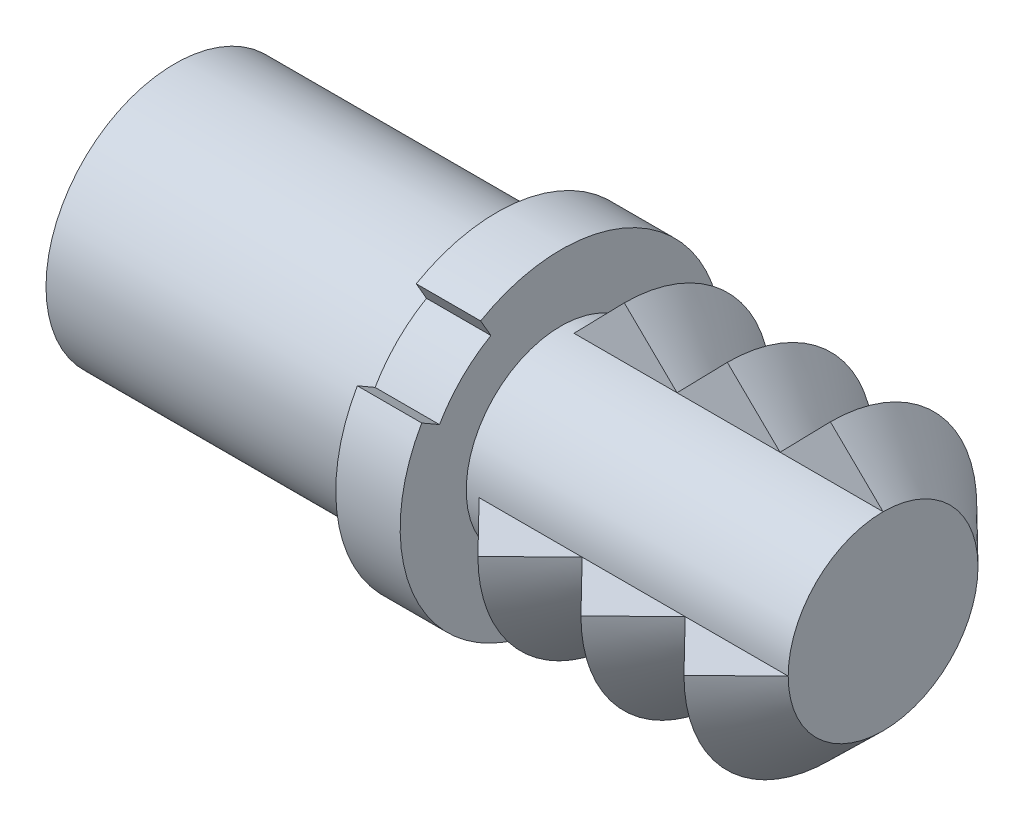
ISO-10303-21;
HEADER;
FILE_DESCRIPTION(('STEP AP214'),'2;1');
FILE_NAME('part.step','',(''),(''),'','','');
FILE_SCHEMA(('AUTOMOTIVE_DESIGN { 1 0 10303 214 1 1 1 1 }'));
ENDSEC;
DATA;
#1=APPLICATION_CONTEXT('core data for automotive mechanical design processes');
#2=APPLICATION_PROTOCOL_DEFINITION('international standard','automotive_design',2000,#1);
#3=PRODUCT_CONTEXT('',#1,'mechanical');
#4=PRODUCT('Part','Part','',(#3));
#5=PRODUCT_RELATED_PRODUCT_CATEGORY('part','',(#4));
#6=PRODUCT_DEFINITION_FORMATION('','',#4);
#7=PRODUCT_DEFINITION_CONTEXT('part definition',#1,'design');
#8=PRODUCT_DEFINITION('design','',#6,#7);
#9=PRODUCT_DEFINITION_SHAPE('','',#8);
#10=(LENGTH_UNIT() NAMED_UNIT(*) SI_UNIT(.MILLI.,.METRE.));
#11=(NAMED_UNIT(*) PLANE_ANGLE_UNIT() SI_UNIT($,.RADIAN.));
#12=(NAMED_UNIT(*) SI_UNIT($,.STERADIAN.) SOLID_ANGLE_UNIT());
#13=UNCERTAINTY_MEASURE_WITH_UNIT(LENGTH_MEASURE(1.E-05),#10,'distance_accuracy_value','');
#14=(GEOMETRIC_REPRESENTATION_CONTEXT(3) GLOBAL_UNCERTAINTY_ASSIGNED_CONTEXT((#13)) GLOBAL_UNIT_ASSIGNED_CONTEXT((#10,
#11,#12)) REPRESENTATION_CONTEXT('',''));
#15=CARTESIAN_POINT('',(0.,0.,0.));
#16=DIRECTION('',(0.,0.,1.));
#17=DIRECTION('',(1.,0.,0.));
#18=AXIS2_PLACEMENT_3D('',#15,#16,#17);
#19=CARTESIAN_POINT('',(18.8096962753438,-7.3213113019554,0.));
#20=DIRECTION('',(-1.,0.,0.));
#21=DIRECTION('',(0.,0.,1.));
#22=AXIS2_PLACEMENT_3D('',#19,#20,#21);
#23=CONICAL_SURFACE('',#22,3.74350399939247,0.773626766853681);
#24=DIRECTION('',(-0.7153812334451,0.,-0.698734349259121));
#25=VECTOR('',#24,1.);
#26=CARTESIAN_POINT('',(22.6423867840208,-7.3213113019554,0.));
#27=LINE('',#26,#25);
#28=CARTESIAN_POINT('',(16.7298617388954,-7.3213113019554,-5.77494089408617));
#29=VERTEX_POINT('',#28);
#30=CARTESIAN_POINT('',(18.8096962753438,-7.3213113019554,-3.74350399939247));
#31=VERTEX_POINT('',#30);
#32=EDGE_CURVE('E220',#29,#31,#27,.F.);
#33=ORIENTED_EDGE('',*,*,#32,.F.);
#34=CARTESIAN_POINT('',(16.7298617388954,-7.3213113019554,0.));
#35=DIRECTION('',(1.,0.,0.));
#36=DIRECTION('',(0.,0.,-1.));
#37=AXIS2_PLACEMENT_3D('',#34,#35,#36);
#38=CIRCLE('',#37,5.77494089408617);
#39=CARTESIAN_POINT('',(16.7298617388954,-1.54637040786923,0.));
#40=VERTEX_POINT('',#39);
#41=EDGE_CURVE('E244',#29,#40,#38,.T.);
#42=ORIENTED_EDGE('',*,*,#41,.T.);
#43=DIRECTION('',(0.7153812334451,-0.698734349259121,0.));
#44=VECTOR('',#43,1.);
#45=CARTESIAN_POINT('',(22.6423867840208,-7.3213113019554,0.));
#46=LINE('',#45,#44);
#47=CARTESIAN_POINT('',(18.8096962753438,-3.57780730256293,0.));
#48=VERTEX_POINT('',#47);
#49=EDGE_CURVE('E343',#48,#40,#46,.F.);
#50=ORIENTED_EDGE('',*,*,#49,.F.);
#51=CARTESIAN_POINT('',(18.8096962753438,-7.3213113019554,0.));
#52=DIRECTION('',(1.,0.,0.));
#53=DIRECTION('',(0.,0.,-1.));
#54=AXIS2_PLACEMENT_3D('',#51,#52,#53);
#55=CIRCLE('',#54,3.74350399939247);
#56=EDGE_CURVE('E248',#31,#48,#55,.T.);
#57=ORIENTED_EDGE('',*,*,#56,.F.);
#58=EDGE_LOOP('',(#33,#42,#50,#57));
#59=FACE_BOUND('',#58,.T.);
#60=ADVANCED_FACE('F35',(#59),#23,.T.);
#61=CARTESIAN_POINT('',(16.7298617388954,-7.3213113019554,0.));
#62=DIRECTION('',(1.,0.,0.));
#63=DIRECTION('',(0.,0.,-1.));
#64=AXIS2_PLACEMENT_3D('',#61,#62,#63);
#65=CONICAL_SURFACE('',#64,5.77494089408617,0.797169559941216);
#66=DIRECTION('',(-0.69873434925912,0.,0.715381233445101));
#67=VECTOR('',#66,1.);
#68=CARTESIAN_POINT('',(11.0893034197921,-7.3213113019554,0.));
#69=LINE('',#68,#67);
#70=CARTESIAN_POINT('',(14.7456962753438,-7.3213113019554,-3.74350399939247));
#71=VERTEX_POINT('',#70);
#72=EDGE_CURVE('E224',#71,#29,#69,.F.);
#73=ORIENTED_EDGE('',*,*,#72,.F.);
#74=CARTESIAN_POINT('',(14.7456962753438,-7.3213113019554,0.));
#75=DIRECTION('',(1.,0.,0.));
#76=DIRECTION('',(0.,0.,-1.));
#77=AXIS2_PLACEMENT_3D('',#74,#75,#76);
#78=CIRCLE('',#77,3.74350399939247);
#79=CARTESIAN_POINT('',(14.7456962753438,-3.57780730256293,0.));
#80=VERTEX_POINT('',#79);
#81=EDGE_CURVE('E240',#71,#80,#78,.T.);
#82=ORIENTED_EDGE('',*,*,#81,.T.);
#83=DIRECTION('',(0.69873434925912,0.715381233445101,0.));
#84=VECTOR('',#83,1.);
#85=CARTESIAN_POINT('',(11.0893034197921,-7.3213113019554,0.));
#86=LINE('',#85,#84);
#87=EDGE_CURVE('E341',#40,#80,#86,.F.);
#88=ORIENTED_EDGE('',*,*,#87,.F.);
#89=ORIENTED_EDGE('',*,*,#41,.F.);
#90=EDGE_LOOP('',(#73,#82,#88,#89));
#91=FACE_BOUND('',#90,.T.);
#92=ADVANCED_FACE('F276',(#91),#65,.T.);
#93=CARTESIAN_POINT('',(14.7456962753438,-7.3213113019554,0.));
#94=DIRECTION('',(-1.,0.,0.));
#95=DIRECTION('',(0.,0.,1.));
#96=AXIS2_PLACEMENT_3D('',#93,#94,#95);
#97=CONICAL_SURFACE('',#96,3.74350399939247,0.773626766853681);
#98=DIRECTION('',(-0.7153812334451,0.,-0.698734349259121));
#99=VECTOR('',#98,1.);
#100=CARTESIAN_POINT('',(18.5783867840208,-7.3213113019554,0.));
#101=LINE('',#100,#99);
#102=CARTESIAN_POINT('',(12.6658617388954,-7.3213113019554,-5.77494089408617));
#103=VERTEX_POINT('',#102);
#104=EDGE_CURVE('E364',#103,#71,#101,.F.);
#105=ORIENTED_EDGE('',*,*,#104,.F.);
#106=CARTESIAN_POINT('',(12.6658617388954,-7.3213113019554,0.));
#107=DIRECTION('',(1.,0.,0.));
#108=DIRECTION('',(0.,0.,-1.));
#109=AXIS2_PLACEMENT_3D('',#106,#107,#108);
#110=CIRCLE('',#109,5.77494089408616);
#111=CARTESIAN_POINT('',(12.6658617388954,-1.54637040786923,0.));
#112=VERTEX_POINT('',#111);
#113=EDGE_CURVE('E236',#103,#112,#110,.T.);
#114=ORIENTED_EDGE('',*,*,#113,.T.);
#115=DIRECTION('',(0.7153812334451,-0.698734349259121,0.));
#116=VECTOR('',#115,1.);
#117=CARTESIAN_POINT('',(18.5783867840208,-7.3213113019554,0.));
#118=LINE('',#117,#116);
#119=EDGE_CURVE('E339',#80,#112,#118,.F.);
#120=ORIENTED_EDGE('',*,*,#119,.F.);
#121=ORIENTED_EDGE('',*,*,#81,.F.);
#122=EDGE_LOOP('',(#105,#114,#120,#121));
#123=FACE_BOUND('',#122,.T.);
#124=ADVANCED_FACE('F283',(#123),#97,.T.);
#125=CARTESIAN_POINT('',(12.6658617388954,-7.3213113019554,0.));
#126=DIRECTION('',(1.,0.,0.));
#127=DIRECTION('',(0.,0.,-1.));
#128=AXIS2_PLACEMENT_3D('',#125,#126,#127);
#129=CONICAL_SURFACE('',#128,5.77494089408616,0.797169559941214);
#130=DIRECTION('',(-0.698734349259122,0.,0.715381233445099));
#131=VECTOR('',#130,1.);
#132=CARTESIAN_POINT('',(7.02530341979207,-7.3213113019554,0.));
#133=LINE('',#132,#131);
#134=CARTESIAN_POINT('',(10.6816962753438,-7.3213113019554,-3.74350399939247));
#135=VERTEX_POINT('',#134);
#136=EDGE_CURVE('E362',#135,#103,#133,.F.);
#137=ORIENTED_EDGE('',*,*,#136,.F.);
#138=CARTESIAN_POINT('',(10.6816962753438,-7.3213113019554,0.));
#139=DIRECTION('',(1.,0.,0.));
#140=DIRECTION('',(0.,0.,-1.));
#141=AXIS2_PLACEMENT_3D('',#138,#139,#140);
#142=CIRCLE('',#141,3.74350399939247);
#143=CARTESIAN_POINT('',(10.6816962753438,-3.57780730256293,0.));
#144=VERTEX_POINT('',#143);
#145=EDGE_CURVE('E232',#135,#144,#142,.T.);
#146=ORIENTED_EDGE('',*,*,#145,.T.);
#147=DIRECTION('',(0.698734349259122,0.715381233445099,0.));
#148=VECTOR('',#147,1.);
#149=CARTESIAN_POINT('',(7.02530341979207,-7.3213113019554,0.));
#150=LINE('',#149,#148);
#151=EDGE_CURVE('E337',#112,#144,#150,.F.);
#152=ORIENTED_EDGE('',*,*,#151,.F.);
#153=ORIENTED_EDGE('',*,*,#113,.F.);
#154=EDGE_LOOP('',(#137,#146,#152,#153));
#155=FACE_BOUND('',#154,.T.);
#156=ADVANCED_FACE('F389',(#155),#129,.T.);
#157=CARTESIAN_POINT('',(10.6816962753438,-7.3213113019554,0.));
#158=DIRECTION('',(-1.,0.,0.));
#159=DIRECTION('',(0.,0.,1.));
#160=AXIS2_PLACEMENT_3D('',#157,#158,#159);
#161=CONICAL_SURFACE('',#160,3.74350399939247,0.773626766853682);
#162=DIRECTION('',(-0.7153812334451,0.,-0.698734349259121));
#163=VECTOR('',#162,1.);
#164=CARTESIAN_POINT('',(14.5143867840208,-7.3213113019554,0.));
#165=LINE('',#164,#163);
#166=CARTESIAN_POINT('',(8.60186173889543,-7.3213113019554,-5.77494089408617));
#167=VERTEX_POINT('',#166);
#168=EDGE_CURVE('E309',#167,#135,#165,.F.);
#169=ORIENTED_EDGE('',*,*,#168,.F.);
#170=CARTESIAN_POINT('',(8.60186173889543,-7.3213113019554,0.));
#171=DIRECTION('',(1.,0.,0.));
#172=DIRECTION('',(0.,0.,-1.));
#173=AXIS2_PLACEMENT_3D('',#170,#171,#172);
#174=CIRCLE('',#173,5.77494089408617);
#175=CARTESIAN_POINT('',(8.60186173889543,-1.54637040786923,0.));
#176=VERTEX_POINT('',#175);
#177=EDGE_CURVE('E228',#167,#176,#174,.T.);
#178=ORIENTED_EDGE('',*,*,#177,.T.);
#179=DIRECTION('',(0.7153812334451,-0.698734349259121,0.));
#180=VECTOR('',#179,1.);
#181=CARTESIAN_POINT('',(14.5143867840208,-7.3213113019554,0.));
#182=LINE('',#181,#180);
#183=EDGE_CURVE('E335',#144,#176,#182,.F.);
#184=ORIENTED_EDGE('',*,*,#183,.F.);
#185=ORIENTED_EDGE('',*,*,#145,.F.);
#186=EDGE_LOOP('',(#169,#178,#184,#185));
#187=FACE_BOUND('',#186,.T.);
#188=ADVANCED_FACE('F394',(#187),#161,.T.);
#189=CARTESIAN_POINT('',(8.60186173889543,-7.3213113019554,0.));
#190=DIRECTION('',(1.,0.,0.));
#191=DIRECTION('',(0.,0.,-1.));
#192=AXIS2_PLACEMENT_3D('',#189,#190,#191);
#193=CONICAL_SURFACE('',#192,5.77494089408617,0.797169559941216);
#194=DIRECTION('',(-0.69873434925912,0.,0.715381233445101));
#195=VECTOR('',#194,1.);
#196=CARTESIAN_POINT('',(2.96130341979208,-7.3213113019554,0.));
#197=LINE('',#196,#195);
#198=CARTESIAN_POINT('',(6.61769627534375,-7.3213113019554,-3.74350399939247));
#199=VERTEX_POINT('',#198);
#200=EDGE_CURVE('E11',#199,#167,#197,.F.);
#201=ORIENTED_EDGE('',*,*,#200,.F.);
#202=CARTESIAN_POINT('',(6.61769627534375,-7.3213113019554,0.));
#203=DIRECTION('',(1.,0.,0.));
#204=DIRECTION('',(0.,0.,-1.));
#205=AXIS2_PLACEMENT_3D('',#202,#203,#204);
#206=CIRCLE('',#205,3.74350399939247);
#207=CARTESIAN_POINT('',(6.61769627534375,-3.57780730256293,0.));
#208=VERTEX_POINT('',#207);
#209=EDGE_CURVE('E219',#199,#208,#206,.T.);
#210=ORIENTED_EDGE('',*,*,#209,.T.);
#211=DIRECTION('',(0.69873434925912,0.715381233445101,0.));
#212=VECTOR('',#211,1.);
#213=CARTESIAN_POINT('',(2.96130341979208,-7.3213113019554,0.));
#214=LINE('',#213,#212);
#215=EDGE_CURVE('E195',#176,#208,#214,.F.);
#216=ORIENTED_EDGE('',*,*,#215,.F.);
#217=ORIENTED_EDGE('',*,*,#177,.F.);
#218=EDGE_LOOP('',(#201,#210,#216,#217));
#219=FACE_BOUND('',#218,.T.);
#220=ADVANCED_FACE('F401',(#219),#193,.T.);
#221=CARTESIAN_POINT('',(28.573659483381,-7.3213113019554,0.));
#222=DIRECTION('',(1.,0.,0.));
#223=DIRECTION('',(0.,0.,-1.));
#224=AXIS2_PLACEMENT_3D('',#221,#222,#223);
#225=CYLINDRICAL_SURFACE('',#224,3.74350399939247);
#226=DIRECTION('',(1.,0.,0.));
#227=VECTOR('',#226,1.);
#228=CARTESIAN_POINT('',(6.36369627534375,-11.0648153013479,0.));
#229=LINE('',#228,#227);
#230=CARTESIAN_POINT('',(6.61769627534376,-11.0648153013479,0.));
#231=VERTEX_POINT('',#230);
#232=CARTESIAN_POINT('',(10.6816962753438,-11.0648153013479,0.));
#233=VERTEX_POINT('',#232);
#234=EDGE_CURVE('E200',#231,#233,#229,.T.);
#235=ORIENTED_EDGE('',*,*,#234,.F.);
#236=CARTESIAN_POINT('',(6.61769627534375,-7.3213113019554,3.74350399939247));
#237=VERTEX_POINT('',#236);
#238=EDGE_CURVE('E210',#237,#231,#206,.T.);
#239=ORIENTED_EDGE('',*,*,#238,.F.);
#240=DIRECTION('',(1.,0.,0.));
#241=VECTOR('',#240,1.);
#242=CARTESIAN_POINT('',(6.36369627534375,-7.3213113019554,3.74350399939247));
#243=LINE('',#242,#241);
#244=CARTESIAN_POINT('',(10.6816962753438,-7.3213113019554,3.74350399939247));
#245=VERTEX_POINT('',#244);
#246=EDGE_CURVE('E333',#237,#245,#243,.T.);
#247=ORIENTED_EDGE('',*,*,#246,.T.);
#248=CARTESIAN_POINT('',(14.7456962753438,-7.3213113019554,3.74350399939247));
#249=VERTEX_POINT('',#248);
#250=EDGE_CURVE('E332',#245,#249,#243,.T.);
#251=ORIENTED_EDGE('',*,*,#250,.T.);
#252=CARTESIAN_POINT('',(18.8096962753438,-7.3213113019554,3.74350399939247));
#253=VERTEX_POINT('',#252);
#254=EDGE_CURVE('E331',#249,#253,#243,.T.);
#255=ORIENTED_EDGE('',*,*,#254,.T.);
#256=CARTESIAN_POINT('',(18.8096962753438,-7.3213113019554,0.));
#257=DIRECTION('',(-1.,0.,0.));
#258=DIRECTION('',(0.,0.,-1.));
#259=AXIS2_PLACEMENT_3D('',#256,#257,#258);
#260=CIRCLE('',#259,3.74350399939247);
#261=EDGE_CURVE('E317',#253,#48,#260,.T.);
#262=ORIENTED_EDGE('',*,*,#261,.T.);
#263=DIRECTION('',(1.,0.,0.));
#264=VECTOR('',#263,1.);
#265=CARTESIAN_POINT('',(6.36369627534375,-3.57780730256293,0.));
#266=LINE('',#265,#264);
#267=EDGE_CURVE('E321',#80,#48,#266,.T.);
#268=ORIENTED_EDGE('',*,*,#267,.F.);
#269=EDGE_CURVE('E324',#144,#80,#266,.T.);
#270=ORIENTED_EDGE('',*,*,#269,.F.);
#271=EDGE_CURVE('E326',#208,#144,#266,.T.);
#272=ORIENTED_EDGE('',*,*,#271,.F.);
#273=ORIENTED_EDGE('',*,*,#209,.F.);
#274=DIRECTION('',(1.,0.,0.));
#275=VECTOR('',#274,1.);
#276=CARTESIAN_POINT('',(6.36369627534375,-7.3213113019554,-3.74350399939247));
#277=LINE('',#276,#275);
#278=EDGE_CURVE('E322',#199,#135,#277,.T.);
#279=ORIENTED_EDGE('',*,*,#278,.T.);
#280=EDGE_CURVE('E328',#135,#71,#277,.T.);
#281=ORIENTED_EDGE('',*,*,#280,.T.);
#282=EDGE_CURVE('E214',#71,#31,#277,.T.);
#283=ORIENTED_EDGE('',*,*,#282,.T.);
#284=CARTESIAN_POINT('',(18.8096962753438,-7.3213113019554,0.));
#285=DIRECTION('',(-1.,0.,0.));
#286=DIRECTION('',(0.,0.,1.));
#287=AXIS2_PLACEMENT_3D('',#284,#285,#286);
#288=CIRCLE('',#287,3.74350399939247);
#289=CARTESIAN_POINT('',(18.8096962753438,-11.0648153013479,0.));
#290=VERTEX_POINT('',#289);
#291=EDGE_CURVE('E314',#31,#290,#288,.T.);
#292=ORIENTED_EDGE('',*,*,#291,.T.);
#293=CARTESIAN_POINT('',(14.7456962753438,-11.0648153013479,0.));
#294=VERTEX_POINT('',#293);
#295=EDGE_CURVE('E216',#294,#290,#229,.T.);
#296=ORIENTED_EDGE('',*,*,#295,.F.);
#297=EDGE_CURVE('E213',#233,#294,#229,.T.);
#298=ORIENTED_EDGE('',*,*,#297,.F.);
#299=EDGE_LOOP('',(#235,#239,#247,#251,#255,#262,#268,#270,#272,#273,#279,#281,#283,#292,#296,#298));
#300=FACE_BOUND('',#299,.T.);
#301=CARTESIAN_POINT('',(6.10969627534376,-7.3213113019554,0.));
#302=DIRECTION('',(1.,0.,0.));
#303=DIRECTION('',(0.,0.,-1.));
#304=AXIS2_PLACEMENT_3D('',#301,#302,#303);
#305=CIRCLE('',#304,3.74350399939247);
#306=CARTESIAN_POINT('',(6.10969627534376,-7.3213113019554,-3.74350399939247));
#307=VERTEX_POINT('',#306);
#308=EDGE_CURVE('E186',#307,#307,#305,.T.);
#309=ORIENTED_EDGE('',*,*,#308,.T.);
#310=EDGE_LOOP('',(#309));
#311=FACE_BOUND('',#310,.T.);
#312=ADVANCED_FACE('F37',(#300,#311),#225,.T.);
#313=CARTESIAN_POINT('',(6.10969627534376,0.,0.));
#314=DIRECTION('',(-1.,0.,0.));
#315=DIRECTION('',(0.,0.,1.));
#316=AXIS2_PLACEMENT_3D('',#313,#314,#315);
#317=PLANE('',#316);
#318=ORIENTED_EDGE('',*,*,#308,.F.);
#319=EDGE_LOOP('',(#318));
#320=FACE_BOUND('',#319,.T.);
#321=CARTESIAN_POINT('',(6.10969627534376,-7.3213113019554,0.));
#322=DIRECTION('',(1.,0.,0.));
#323=DIRECTION('',(0.,0.,-1.));
#324=AXIS2_PLACEMENT_3D('',#321,#322,#323);
#325=CIRCLE('',#324,6.35);
#326=CARTESIAN_POINT('',(6.10969627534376,-4.14631130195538,5.49926131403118));
#327=VERTEX_POINT('',#326);
#328=CARTESIAN_POINT('',(6.10969627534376,-1.82204998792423,3.17500000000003));
#329=VERTEX_POINT('',#328);
#330=EDGE_CURVE('E177',#327,#329,#325,.T.);
#331=ORIENTED_EDGE('',*,*,#330,.T.);
#332=DIRECTION('',(0.,0.866025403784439,0.5));
#333=VECTOR('',#332,1.);
#334=CARTESIAN_POINT('',(6.10969627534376,-1.82204998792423,3.17500000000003));
#335=LINE('',#334,#333);
#336=CARTESIAN_POINT('',(6.10969627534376,-2.52206077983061,2.77084858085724));
#337=VERTEX_POINT('',#336);
#338=EDGE_CURVE('E168',#337,#329,#335,.T.);
#339=ORIENTED_EDGE('',*,*,#338,.F.);
#340=CARTESIAN_POINT('',(6.10969627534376,-7.32131130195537,0.));
#341=DIRECTION('',(-1.,0.,0.));
#342=DIRECTION('',(0.,0.,-1.));
#343=AXIS2_PLACEMENT_3D('',#340,#341,#342);
#344=CIRCLE('',#343,5.54169716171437);
#345=CARTESIAN_POINT('',(6.10969627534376,-4.55046272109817,4.7992505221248));
#346=VERTEX_POINT('',#345);
#347=EDGE_CURVE('E416',#346,#337,#344,.T.);
#348=ORIENTED_EDGE('',*,*,#347,.F.);
#349=DIRECTION('',(0.,-0.500000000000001,-0.866025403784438));
#350=VECTOR('',#349,1.);
#351=CARTESIAN_POINT('',(6.10969627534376,-4.14631130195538,5.49926131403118));
#352=LINE('',#351,#350);
#353=EDGE_CURVE('E419',#327,#346,#352,.T.);
#354=ORIENTED_EDGE('',*,*,#353,.F.);
#355=EDGE_LOOP('',(#331,#339,#348,#354));
#356=FACE_BOUND('',#355,.T.);
#357=ADVANCED_FACE('F425',(#320,#356),#317,.F.);
#358=CARTESIAN_POINT('',(28.573659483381,-7.3213113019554,0.));
#359=DIRECTION('',(1.,0.,0.));
#360=DIRECTION('',(0.,0.,-1.));
#361=AXIS2_PLACEMENT_3D('',#358,#359,#360);
#362=CYLINDRICAL_SURFACE('',#361,6.35);
#363=CARTESIAN_POINT('',(3.56969627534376,-7.3213113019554,0.));
#364=DIRECTION('',(1.,0.,0.));
#365=DIRECTION('',(0.,0.,-1.));
#366=AXIS2_PLACEMENT_3D('',#363,#364,#365);
#367=CIRCLE('',#366,6.35);
#368=CARTESIAN_POINT('',(3.56969627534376,-4.14631130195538,5.49926131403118));
#369=VERTEX_POINT('',#368);
#370=CARTESIAN_POINT('',(3.56969627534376,-1.82204998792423,3.17500000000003));
#371=VERTEX_POINT('',#370);
#372=EDGE_CURVE('E175',#369,#371,#367,.T.);
#373=ORIENTED_EDGE('',*,*,#372,.T.);
#374=DIRECTION('',(1.,0.,0.));
#375=VECTOR('',#374,1.);
#376=CARTESIAN_POINT('',(3.56969627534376,-1.82204998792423,3.17500000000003));
#377=LINE('',#376,#375);
#378=EDGE_CURVE('E409',#371,#329,#377,.T.);
#379=ORIENTED_EDGE('',*,*,#378,.T.);
#380=ORIENTED_EDGE('',*,*,#330,.F.);
#381=DIRECTION('',(1.,0.,0.));
#382=VECTOR('',#381,1.);
#383=CARTESIAN_POINT('',(3.56969627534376,-4.14631130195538,5.49926131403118));
#384=LINE('',#383,#382);
#385=EDGE_CURVE('E163',#369,#327,#384,.T.);
#386=ORIENTED_EDGE('',*,*,#385,.F.);
#387=EDGE_LOOP('',(#373,#379,#380,#386));
#388=FACE_BOUND('',#387,.T.);
#389=ADVANCED_FACE('F173',(#388),#362,.T.);
#390=CARTESIAN_POINT('',(3.56969627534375,0.,0.));
#391=DIRECTION('',(1.,0.,0.));
#392=DIRECTION('',(0.,0.,-1.));
#393=AXIS2_PLACEMENT_3D('',#390,#391,#392);
#394=PLANE('',#393);
#395=CARTESIAN_POINT('',(3.56969627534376,-7.32131130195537,0.));
#396=DIRECTION('',(-1.,0.,0.));
#397=DIRECTION('',(0.,0.,-1.));
#398=AXIS2_PLACEMENT_3D('',#395,#396,#397);
#399=CIRCLE('',#398,5.54169716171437);
#400=CARTESIAN_POINT('',(3.56969627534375,-4.55046272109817,4.7992505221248));
#401=VERTEX_POINT('',#400);
#402=CARTESIAN_POINT('',(3.56969627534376,-2.52206077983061,2.77084858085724));
#403=VERTEX_POINT('',#402);
#404=EDGE_CURVE('E50',#401,#403,#399,.T.);
#405=ORIENTED_EDGE('',*,*,#404,.T.);
#406=DIRECTION('',(0.,0.866025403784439,0.5));
#407=VECTOR('',#406,1.);
#408=CARTESIAN_POINT('',(3.56969627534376,-1.82204998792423,3.17500000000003));
#409=LINE('',#408,#407);
#410=EDGE_CURVE('E178',#403,#371,#409,.T.);
#411=ORIENTED_EDGE('',*,*,#410,.T.);
#412=ORIENTED_EDGE('',*,*,#372,.F.);
#413=DIRECTION('',(0.,-0.500000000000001,-0.866025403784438));
#414=VECTOR('',#413,1.);
#415=CARTESIAN_POINT('',(3.56969627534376,-4.14631130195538,5.49926131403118));
#416=LINE('',#415,#414);
#417=EDGE_CURVE('E159',#369,#401,#416,.T.);
#418=ORIENTED_EDGE('',*,*,#417,.T.);
#419=EDGE_LOOP('',(#405,#411,#412,#418));
#420=FACE_BOUND('',#419,.T.);
#421=CARTESIAN_POINT('',(3.56969627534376,-7.3213113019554,0.));
#422=DIRECTION('',(1.,0.,0.));
#423=DIRECTION('',(0.,0.,-1.));
#424=AXIS2_PLACEMENT_3D('',#421,#422,#423);
#425=CIRCLE('',#424,5.08);
#426=CARTESIAN_POINT('',(3.56969627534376,-7.3213113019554,-5.08));
#427=VERTEX_POINT('',#426);
#428=EDGE_CURVE('E184',#427,#427,#425,.T.);
#429=ORIENTED_EDGE('',*,*,#428,.T.);
#430=EDGE_LOOP('',(#429));
#431=FACE_BOUND('',#430,.T.);
#432=ADVANCED_FACE('F181',(#420,#431),#394,.F.);
#433=CARTESIAN_POINT('',(28.573659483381,-7.3213113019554,0.));
#434=DIRECTION('',(1.,0.,0.));
#435=DIRECTION('',(0.,0.,-1.));
#436=AXIS2_PLACEMENT_3D('',#433,#434,#435);
#437=CYLINDRICAL_SURFACE('',#436,5.08);
#438=CARTESIAN_POINT('',(-9.13030372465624,-7.3213113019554,0.));
#439=DIRECTION('',(1.,0.,0.));
#440=DIRECTION('',(0.,0.,-1.));
#441=AXIS2_PLACEMENT_3D('',#438,#439,#440);
#442=CIRCLE('',#441,5.08);
#443=CARTESIAN_POINT('',(-9.13030372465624,-7.3213113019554,-5.08));
#444=VERTEX_POINT('',#443);
#445=EDGE_CURVE('E189',#444,#444,#442,.T.);
#446=ORIENTED_EDGE('',*,*,#445,.T.);
#447=EDGE_LOOP('',(#446));
#448=FACE_BOUND('',#447,.T.);
#449=ORIENTED_EDGE('',*,*,#428,.F.);
#450=EDGE_LOOP('',(#449));
#451=FACE_BOUND('',#450,.T.);
#452=ADVANCED_FACE('F259',(#448,#451),#437,.T.);
#453=CARTESIAN_POINT('',(-9.13030372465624,0.,0.));
#454=DIRECTION('',(-1.,0.,0.));
#455=DIRECTION('',(0.,0.,1.));
#456=AXIS2_PLACEMENT_3D('',#453,#454,#455);
#457=PLANE('',#456);
#458=CARTESIAN_POINT('',(-9.13030372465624,-7.3213113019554,0.));
#459=DIRECTION('',(1.,0.,0.));
#460=DIRECTION('',(0.,0.,-1.));
#461=AXIS2_PLACEMENT_3D('',#458,#459,#460);
#462=CIRCLE('',#461,2.54);
#463=CARTESIAN_POINT('',(-9.13030372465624,-7.3213113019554,-2.54));
#464=VERTEX_POINT('',#463);
#465=EDGE_CURVE('E254',#464,#464,#462,.T.);
#466=ORIENTED_EDGE('',*,*,#465,.T.);
#467=EDGE_LOOP('',(#466));
#468=FACE_BOUND('',#467,.T.);
#469=ORIENTED_EDGE('',*,*,#445,.F.);
#470=EDGE_LOOP('',(#469));
#471=FACE_BOUND('',#470,.T.);
#472=ADVANCED_FACE('F262',(#468,#471),#457,.T.);
#473=CARTESIAN_POINT('',(28.573659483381,-7.3213113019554,0.));
#474=DIRECTION('',(1.,0.,0.));
#475=DIRECTION('',(0.,0.,-1.));
#476=AXIS2_PLACEMENT_3D('',#473,#474,#475);
#477=CYLINDRICAL_SURFACE('',#476,2.54);
#478=CARTESIAN_POINT('',(3.56969627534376,-7.3213113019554,0.));
#479=DIRECTION('',(1.,0.,0.));
#480=DIRECTION('',(0.,0.,-1.));
#481=AXIS2_PLACEMENT_3D('',#478,#479,#480);
#482=CIRCLE('',#481,2.54);
#483=CARTESIAN_POINT('',(3.56969627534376,-7.3213113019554,-2.54));
#484=VERTEX_POINT('',#483);
#485=EDGE_CURVE('E251',#484,#484,#482,.T.);
#486=ORIENTED_EDGE('',*,*,#485,.T.);
#487=EDGE_LOOP('',(#486));
#488=FACE_BOUND('',#487,.T.);
#489=ORIENTED_EDGE('',*,*,#465,.F.);
#490=EDGE_LOOP('',(#489));
#491=FACE_BOUND('',#490,.T.);
#492=ADVANCED_FACE('F264',(#488,#491),#477,.F.);
#493=CARTESIAN_POINT('',(3.56969627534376,0.,0.));
#494=DIRECTION('',(-1.,0.,0.));
#495=DIRECTION('',(0.,0.,1.));
#496=AXIS2_PLACEMENT_3D('',#493,#494,#495);
#497=PLANE('',#496);
#498=ORIENTED_EDGE('',*,*,#485,.F.);
#499=EDGE_LOOP('',(#498));
#500=FACE_BOUND('',#499,.T.);
#501=ADVANCED_FACE('F271',(#500),#497,.T.);
#502=CARTESIAN_POINT('',(18.8096962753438,0.,0.));
#503=DIRECTION('',(-1.,0.,0.));
#504=DIRECTION('',(0.,0.,1.));
#505=AXIS2_PLACEMENT_3D('',#502,#503,#504);
#506=PLANE('',#505);
#507=ORIENTED_EDGE('',*,*,#56,.T.);
#508=ORIENTED_EDGE('',*,*,#261,.F.);
#509=EDGE_CURVE('E247',#253,#290,#55,.T.);
#510=ORIENTED_EDGE('',*,*,#509,.T.);
#511=ORIENTED_EDGE('',*,*,#291,.F.);
#512=EDGE_LOOP('',(#507,#508,#510,#511));
#513=FACE_BOUND('',#512,.T.);
#514=ADVANCED_FACE('F290',(#513),#506,.F.);
#515=DIRECTION('',(0.7153812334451,0.698734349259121,0.));
#516=VECTOR('',#515,1.);
#517=CARTESIAN_POINT('',(22.6423867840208,-7.3213113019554,0.));
#518=LINE('',#517,#516);
#519=CARTESIAN_POINT('',(16.7298617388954,-13.0962521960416,0.));
#520=VERTEX_POINT('',#519);
#521=EDGE_CURVE('E302',#290,#520,#518,.F.);
#522=ORIENTED_EDGE('',*,*,#521,.F.);
#523=ORIENTED_EDGE('',*,*,#509,.F.);
#524=DIRECTION('',(-0.7153812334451,0.,0.698734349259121));
#525=VECTOR('',#524,1.);
#526=CARTESIAN_POINT('',(22.6423867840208,-7.3213113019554,0.));
#527=LINE('',#526,#525);
#528=CARTESIAN_POINT('',(16.7298617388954,-7.3213113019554,5.77494089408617));
#529=VERTEX_POINT('',#528);
#530=EDGE_CURVE('E353',#529,#253,#527,.F.);
#531=ORIENTED_EDGE('',*,*,#530,.F.);
#532=EDGE_CURVE('E243',#529,#520,#38,.T.);
#533=ORIENTED_EDGE('',*,*,#532,.T.);
#534=EDGE_LOOP('',(#522,#523,#531,#533));
#535=FACE_BOUND('',#534,.T.);
#536=ADVANCED_FACE('F279',(#535),#23,.T.);
#537=DIRECTION('',(0.69873434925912,-0.715381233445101,0.));
#538=VECTOR('',#537,1.);
#539=CARTESIAN_POINT('',(11.0893034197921,-7.3213113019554,0.));
#540=LINE('',#539,#538);
#541=EDGE_CURVE('E310',#520,#294,#540,.F.);
#542=ORIENTED_EDGE('',*,*,#541,.F.);
#543=ORIENTED_EDGE('',*,*,#532,.F.);
#544=DIRECTION('',(-0.69873434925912,0.,-0.715381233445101));
#545=VECTOR('',#544,1.);
#546=CARTESIAN_POINT('',(11.0893034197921,-7.3213113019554,0.));
#547=LINE('',#546,#545);
#548=EDGE_CURVE('E351',#249,#529,#547,.F.);
#549=ORIENTED_EDGE('',*,*,#548,.F.);
#550=EDGE_CURVE('E239',#249,#294,#78,.T.);
#551=ORIENTED_EDGE('',*,*,#550,.T.);
#552=EDGE_LOOP('',(#542,#543,#549,#551));
#553=FACE_BOUND('',#552,.T.);
#554=ADVANCED_FACE('F286',(#553),#65,.T.);
#555=DIRECTION('',(0.7153812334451,0.698734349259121,0.));
#556=VECTOR('',#555,1.);
#557=CARTESIAN_POINT('',(18.5783867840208,-7.3213113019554,0.));
#558=LINE('',#557,#556);
#559=CARTESIAN_POINT('',(12.6658617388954,-13.0962521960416,0.));
#560=VERTEX_POINT('',#559);
#561=EDGE_CURVE('E358',#294,#560,#558,.F.);
#562=ORIENTED_EDGE('',*,*,#561,.F.);
#563=ORIENTED_EDGE('',*,*,#550,.F.);
#564=DIRECTION('',(-0.7153812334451,0.,0.698734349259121));
#565=VECTOR('',#564,1.);
#566=CARTESIAN_POINT('',(18.5783867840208,-7.3213113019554,0.));
#567=LINE('',#566,#565);
#568=CARTESIAN_POINT('',(12.6658617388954,-7.3213113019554,5.77494089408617));
#569=VERTEX_POINT('',#568);
#570=EDGE_CURVE('E349',#569,#249,#567,.F.);
#571=ORIENTED_EDGE('',*,*,#570,.F.);
#572=EDGE_CURVE('E235',#569,#560,#110,.T.);
#573=ORIENTED_EDGE('',*,*,#572,.T.);
#574=EDGE_LOOP('',(#562,#563,#571,#573));
#575=FACE_BOUND('',#574,.T.);
#576=ADVANCED_FACE('F296',(#575),#97,.T.);
#577=DIRECTION('',(0.698734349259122,-0.715381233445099,0.));
#578=VECTOR('',#577,1.);
#579=CARTESIAN_POINT('',(7.02530341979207,-7.3213113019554,0.));
#580=LINE('',#579,#578);
#581=EDGE_CURVE('E356',#560,#233,#580,.F.);
#582=ORIENTED_EDGE('',*,*,#581,.F.);
#583=ORIENTED_EDGE('',*,*,#572,.F.);
#584=DIRECTION('',(-0.698734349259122,0.,-0.715381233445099));
#585=VECTOR('',#584,1.);
#586=CARTESIAN_POINT('',(7.02530341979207,-7.3213113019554,0.));
#587=LINE('',#586,#585);
#588=EDGE_CURVE('E347',#245,#569,#587,.F.);
#589=ORIENTED_EDGE('',*,*,#588,.F.);
#590=EDGE_CURVE('E231',#245,#233,#142,.T.);
#591=ORIENTED_EDGE('',*,*,#590,.T.);
#592=EDGE_LOOP('',(#582,#583,#589,#591));
#593=FACE_BOUND('',#592,.T.);
#594=ADVANCED_FACE('F457',(#593),#129,.T.);
#595=DIRECTION('',(0.7153812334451,0.698734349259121,0.));
#596=VECTOR('',#595,1.);
#597=CARTESIAN_POINT('',(14.5143867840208,-7.3213113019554,0.));
#598=LINE('',#597,#596);
#599=CARTESIAN_POINT('',(8.60186173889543,-13.0962521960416,0.));
#600=VERTEX_POINT('',#599);
#601=EDGE_CURVE('E58',#233,#600,#598,.F.);
#602=ORIENTED_EDGE('',*,*,#601,.F.);
#603=ORIENTED_EDGE('',*,*,#590,.F.);
#604=DIRECTION('',(-0.7153812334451,0.,0.698734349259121));
#605=VECTOR('',#604,1.);
#606=CARTESIAN_POINT('',(14.5143867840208,-7.3213113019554,0.));
#607=LINE('',#606,#605);
#608=CARTESIAN_POINT('',(8.60186173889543,-7.3213113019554,5.77494089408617));
#609=VERTEX_POINT('',#608);
#610=EDGE_CURVE('E345',#609,#245,#607,.F.);
#611=ORIENTED_EDGE('',*,*,#610,.F.);
#612=EDGE_CURVE('E223',#609,#600,#174,.T.);
#613=ORIENTED_EDGE('',*,*,#612,.T.);
#614=EDGE_LOOP('',(#602,#603,#611,#613));
#615=FACE_BOUND('',#614,.T.);
#616=ADVANCED_FACE('F454',(#615),#161,.T.);
#617=DIRECTION('',(0.69873434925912,-0.715381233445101,0.));
#618=VECTOR('',#617,1.);
#619=CARTESIAN_POINT('',(2.96130341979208,-7.3213113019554,0.));
#620=LINE('',#619,#618);
#621=EDGE_CURVE('E43',#600,#231,#620,.F.);
#622=ORIENTED_EDGE('',*,*,#621,.F.);
#623=ORIENTED_EDGE('',*,*,#612,.F.);
#624=DIRECTION('',(-0.69873434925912,0.,-0.715381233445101));
#625=VECTOR('',#624,1.);
#626=CARTESIAN_POINT('',(2.96130341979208,-7.3213113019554,0.));
#627=LINE('',#626,#625);
#628=EDGE_CURVE('E197',#237,#609,#627,.F.);
#629=ORIENTED_EDGE('',*,*,#628,.F.);
#630=ORIENTED_EDGE('',*,*,#238,.T.);
#631=EDGE_LOOP('',(#622,#623,#629,#630));
#632=FACE_BOUND('',#631,.T.);
#633=ADVANCED_FACE('F218',(#632),#193,.T.);
#634=CARTESIAN_POINT('',(6.36369627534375,-7.3213113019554,3.74350399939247));
#635=DIRECTION('',(0.,-1.,0.));
#636=DIRECTION('',(0.,0.,-1.));
#637=AXIS2_PLACEMENT_3D('',#634,#635,#636);
#638=PLANE('',#637);
#639=ORIENTED_EDGE('',*,*,#530,.T.);
#640=ORIENTED_EDGE('',*,*,#254,.F.);
#641=ORIENTED_EDGE('',*,*,#548,.T.);
#642=EDGE_LOOP('',(#639,#640,#641));
#643=FACE_BOUND('',#642,.T.);
#644=ADVANCED_FACE('F448',(#643),#638,.F.);
#645=ORIENTED_EDGE('',*,*,#570,.T.);
#646=ORIENTED_EDGE('',*,*,#250,.F.);
#647=ORIENTED_EDGE('',*,*,#588,.T.);
#648=EDGE_LOOP('',(#645,#646,#647));
#649=FACE_BOUND('',#648,.T.);
#650=ADVANCED_FACE('F449',(#649),#638,.F.);
#651=CARTESIAN_POINT('',(6.36369627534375,-3.57780730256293,0.));
#652=DIRECTION('',(0.,0.,-1.));
#653=DIRECTION('',(-1.,0.,0.));
#654=AXIS2_PLACEMENT_3D('',#651,#652,#653);
#655=PLANE('',#654);
#656=ORIENTED_EDGE('',*,*,#49,.T.);
#657=ORIENTED_EDGE('',*,*,#87,.T.);
#658=ORIENTED_EDGE('',*,*,#267,.T.);
#659=EDGE_LOOP('',(#656,#657,#658));
#660=FACE_BOUND('',#659,.T.);
#661=ADVANCED_FACE('F375',(#660),#655,.F.);
#662=ORIENTED_EDGE('',*,*,#119,.T.);
#663=ORIENTED_EDGE('',*,*,#151,.T.);
#664=ORIENTED_EDGE('',*,*,#269,.T.);
#665=EDGE_LOOP('',(#662,#663,#664));
#666=FACE_BOUND('',#665,.T.);
#667=ADVANCED_FACE('F382',(#666),#655,.F.);
#668=ORIENTED_EDGE('',*,*,#610,.T.);
#669=ORIENTED_EDGE('',*,*,#246,.F.);
#670=ORIENTED_EDGE('',*,*,#628,.T.);
#671=EDGE_LOOP('',(#668,#669,#670));
#672=FACE_BOUND('',#671,.T.);
#673=ADVANCED_FACE('F444',(#672),#638,.F.);
#674=ORIENTED_EDGE('',*,*,#183,.T.);
#675=ORIENTED_EDGE('',*,*,#215,.T.);
#676=ORIENTED_EDGE('',*,*,#271,.T.);
#677=EDGE_LOOP('',(#674,#675,#676));
#678=FACE_BOUND('',#677,.T.);
#679=ADVANCED_FACE('F398',(#678),#655,.F.);
#680=CARTESIAN_POINT('',(6.36369627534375,-7.3213113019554,-3.74350399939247));
#681=DIRECTION('',(0.,1.,0.));
#682=DIRECTION('',(0.,0.,1.));
#683=AXIS2_PLACEMENT_3D('',#680,#681,#682);
#684=PLANE('',#683);
#685=ORIENTED_EDGE('',*,*,#32,.T.);
#686=ORIENTED_EDGE('',*,*,#282,.F.);
#687=ORIENTED_EDGE('',*,*,#72,.T.);
#688=EDGE_LOOP('',(#685,#686,#687));
#689=FACE_BOUND('',#688,.T.);
#690=ADVANCED_FACE('F368',(#689),#684,.F.);
#691=ORIENTED_EDGE('',*,*,#104,.T.);
#692=ORIENTED_EDGE('',*,*,#280,.F.);
#693=ORIENTED_EDGE('',*,*,#136,.T.);
#694=EDGE_LOOP('',(#691,#692,#693));
#695=FACE_BOUND('',#694,.T.);
#696=ADVANCED_FACE('F407',(#695),#684,.F.);
#697=CARTESIAN_POINT('',(6.36369627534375,-11.0648153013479,0.));
#698=DIRECTION('',(0.,0.,1.));
#699=DIRECTION('',(0.,-1.,0.));
#700=AXIS2_PLACEMENT_3D('',#697,#698,#699);
#701=PLANE('',#700);
#702=ORIENTED_EDGE('',*,*,#521,.T.);
#703=ORIENTED_EDGE('',*,*,#541,.T.);
#704=ORIENTED_EDGE('',*,*,#295,.T.);
#705=EDGE_LOOP('',(#702,#703,#704));
#706=FACE_BOUND('',#705,.T.);
#707=ADVANCED_FACE('F437',(#706),#701,.F.);
#708=ORIENTED_EDGE('',*,*,#561,.T.);
#709=ORIENTED_EDGE('',*,*,#581,.T.);
#710=ORIENTED_EDGE('',*,*,#297,.T.);
#711=EDGE_LOOP('',(#708,#709,#710));
#712=FACE_BOUND('',#711,.T.);
#713=ADVANCED_FACE('F438',(#712),#701,.F.);
#714=ORIENTED_EDGE('',*,*,#168,.T.);
#715=ORIENTED_EDGE('',*,*,#278,.F.);
#716=ORIENTED_EDGE('',*,*,#200,.T.);
#717=EDGE_LOOP('',(#714,#715,#716));
#718=FACE_BOUND('',#717,.T.);
#719=ADVANCED_FACE('F405',(#718),#684,.F.);
#720=ORIENTED_EDGE('',*,*,#601,.T.);
#721=ORIENTED_EDGE('',*,*,#621,.T.);
#722=ORIENTED_EDGE('',*,*,#234,.T.);
#723=EDGE_LOOP('',(#720,#721,#722));
#724=FACE_BOUND('',#723,.T.);
#725=ADVANCED_FACE('F199',(#724),#701,.F.);
#726=CARTESIAN_POINT('',(3.56969627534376,-1.82204998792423,3.17500000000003));
#727=DIRECTION('',(0.,0.5,-0.866025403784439));
#728=DIRECTION('',(0.,0.866025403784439,0.5));
#729=AXIS2_PLACEMENT_3D('',#726,#727,#728);
#730=PLANE('',#729);
#731=ORIENTED_EDGE('',*,*,#338,.T.);
#732=ORIENTED_EDGE('',*,*,#378,.F.);
#733=ORIENTED_EDGE('',*,*,#410,.F.);
#734=DIRECTION('',(1.,0.,0.));
#735=VECTOR('',#734,1.);
#736=CARTESIAN_POINT('',(3.56969627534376,-2.52206077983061,2.77084858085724));
#737=LINE('',#736,#735);
#738=EDGE_CURVE('E412',#403,#337,#737,.T.);
#739=ORIENTED_EDGE('',*,*,#738,.T.);
#740=EDGE_LOOP('',(#731,#732,#733,#739));
#741=FACE_BOUND('',#740,.T.);
#742=ADVANCED_FACE('F428',(#741),#730,.F.);
#743=CARTESIAN_POINT('',(3.56969627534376,-7.32131130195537,0.));
#744=DIRECTION('',(1.,0.,0.));
#745=DIRECTION('',(0.,0.,-1.));
#746=AXIS2_PLACEMENT_3D('',#743,#744,#745);
#747=CYLINDRICAL_SURFACE('',#746,5.54169716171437);
#748=ORIENTED_EDGE('',*,*,#347,.T.);
#749=ORIENTED_EDGE('',*,*,#738,.F.);
#750=ORIENTED_EDGE('',*,*,#404,.F.);
#751=DIRECTION('',(1.,0.,0.));
#752=VECTOR('',#751,1.);
#753=CARTESIAN_POINT('',(3.56969627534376,-4.55046272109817,4.7992505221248));
#754=LINE('',#753,#752);
#755=EDGE_CURVE('E165',#401,#346,#754,.T.);
#756=ORIENTED_EDGE('',*,*,#755,.T.);
#757=EDGE_LOOP('',(#748,#749,#750,#756));
#758=FACE_BOUND('',#757,.T.);
#759=ADVANCED_FACE('F426',(#758),#747,.T.);
#760=CARTESIAN_POINT('',(3.56969627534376,-4.14631130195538,5.49926131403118));
#761=DIRECTION('',(0.,-0.866025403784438,0.500000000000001));
#762=DIRECTION('',(0.,-0.500000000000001,-0.866025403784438));
#763=AXIS2_PLACEMENT_3D('',#760,#761,#762);
#764=PLANE('',#763);
#765=ORIENTED_EDGE('',*,*,#353,.T.);
#766=ORIENTED_EDGE('',*,*,#755,.F.);
#767=ORIENTED_EDGE('',*,*,#417,.F.);
#768=ORIENTED_EDGE('',*,*,#385,.T.);
#769=EDGE_LOOP('',(#765,#766,#767,#768));
#770=FACE_BOUND('',#769,.T.);
#771=ADVANCED_FACE('F162',(#770),#764,.F.);
#772=CLOSED_SHELL('',(#60,#92,#124,#156,#188,#220,#312,#357,#389,#432,#452,#472,#492,#501,#514,
#536,#554,#576,#594,#616,#633,#644,#650,#661,#667,#673,#679,#690,#696,#707,#713,#719,#725,#742,
#759,#771));
#773=MANIFOLD_SOLID_BREP('B2',#772);
#774=ADVANCED_BREP_SHAPE_REPRESENTATION('',(#18,#773),#14);
#775=SHAPE_DEFINITION_REPRESENTATION(#9,#774);
ENDSEC;
END-ISO-10303-21;
